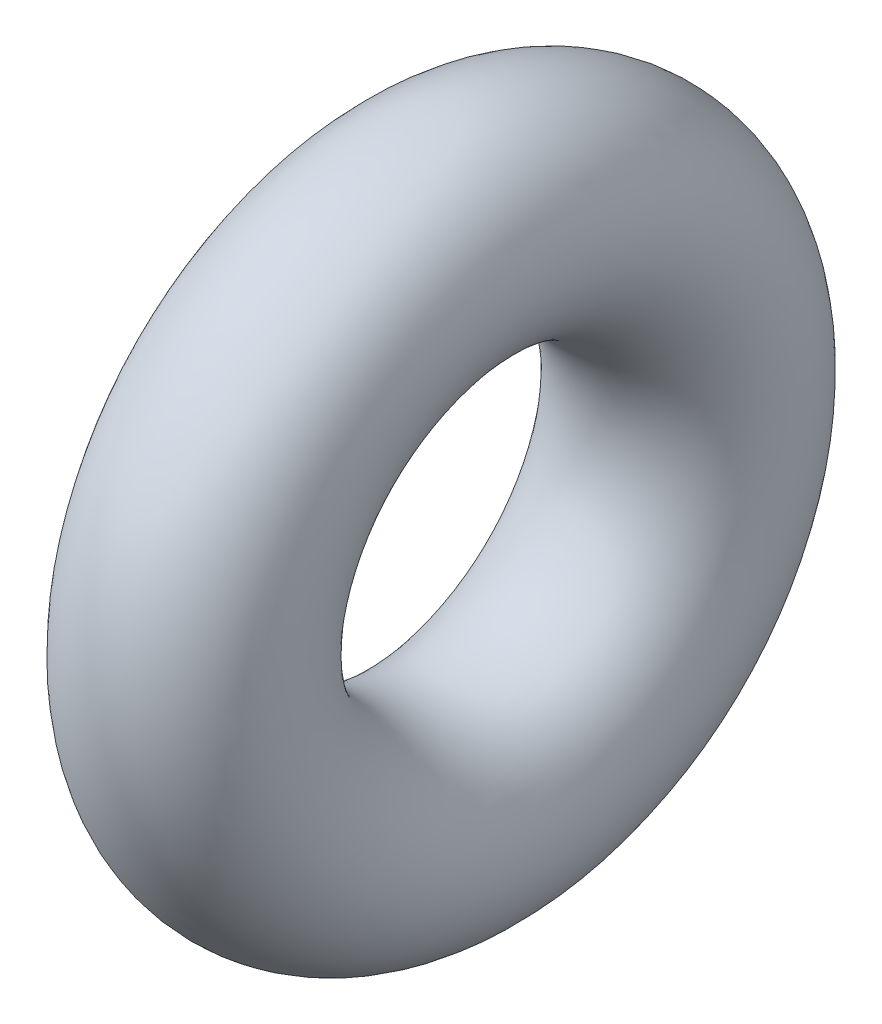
ISO-10303-21;
HEADER;
FILE_DESCRIPTION(('STEP AP214'),'2;1');
FILE_NAME('part.step','',(''),(''),'','','');
FILE_SCHEMA(('AUTOMOTIVE_DESIGN { 1 0 10303 214 1 1 1 1 }'));
ENDSEC;
DATA;
#1=APPLICATION_CONTEXT('core data for automotive mechanical design processes');
#2=APPLICATION_PROTOCOL_DEFINITION('international standard','automotive_design',2000,#1);
#3=PRODUCT_CONTEXT('',#1,'mechanical');
#4=PRODUCT('Part','Part','',(#3));
#5=PRODUCT_RELATED_PRODUCT_CATEGORY('part','',(#4));
#6=PRODUCT_DEFINITION_FORMATION('','',#4);
#7=PRODUCT_DEFINITION_CONTEXT('part definition',#1,'design');
#8=PRODUCT_DEFINITION('design','',#6,#7);
#9=PRODUCT_DEFINITION_SHAPE('','',#8);
#10=(LENGTH_UNIT() NAMED_UNIT(*) SI_UNIT(.MILLI.,.METRE.));
#11=(NAMED_UNIT(*) PLANE_ANGLE_UNIT() SI_UNIT($,.RADIAN.));
#12=(NAMED_UNIT(*) SI_UNIT($,.STERADIAN.) SOLID_ANGLE_UNIT());
#13=UNCERTAINTY_MEASURE_WITH_UNIT(LENGTH_MEASURE(1.E-05),#10,'distance_accuracy_value','');
#14=(GEOMETRIC_REPRESENTATION_CONTEXT(3) GLOBAL_UNCERTAINTY_ASSIGNED_CONTEXT((#13)) GLOBAL_UNIT_ASSIGNED_CONTEXT((#10,
#11,#12)) REPRESENTATION_CONTEXT('',''));
#15=CARTESIAN_POINT('',(0.,0.,0.));
#16=DIRECTION('',(0.,0.,1.));
#17=DIRECTION('',(1.,0.,0.));
#18=AXIS2_PLACEMENT_3D('',#15,#16,#17);
#19=CARTESIAN_POINT('',(7.1,5.54491299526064,0.));
#20=DIRECTION('',(-1.,0.,0.));
#21=DIRECTION('',(0.,0.,1.));
#22=AXIS2_PLACEMENT_3D('',#19,#20,#21);
#23=TOROIDAL_SURFACE('',#22,1.9,0.800000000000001);
#24=CARTESIAN_POINT('',(7.1,5.54491299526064,2.70000000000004));
#25=VERTEX_POINT('',#24);
#26=VERTEX_LOOP('',#25);
#27=FACE_BOUND('',#26,.T.);
#28=ADVANCED_FACE('F24',(#27),#23,.T.);
#29=CLOSED_SHELL('',(#28));
#30=MANIFOLD_SOLID_BREP('B2',#29);
#31=ADVANCED_BREP_SHAPE_REPRESENTATION('',(#18,#30),#14);
#32=SHAPE_DEFINITION_REPRESENTATION(#9,#31);
ENDSEC;
END-ISO-10303-21;
